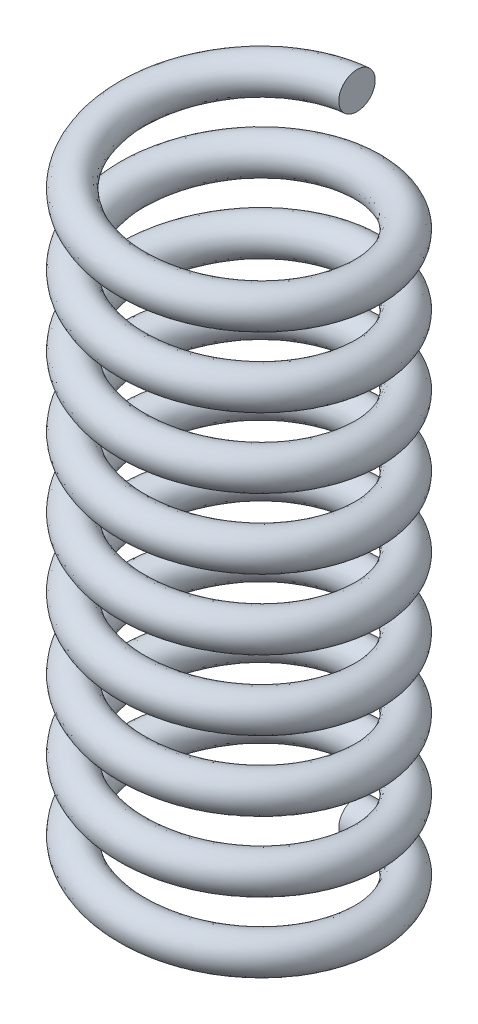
from build123d import *

# Parameters (mm, degrees)
AUSTRAGUNG2_PITCH       = 2.222222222
AUSTRAGUNG2_HEIGHT      = 20
AUSTRAGUNG2_RADIUS      = 3.75
AUSTRAGUNG2_START_ANGLE = -180
SKIZZE2_R               = 0.58


with BuildPart() as part:
    # Austragung2: sweep along a helix
    with BuildLine() as austragung2_path:
        add(Helix(AUSTRAGUNG2_PITCH, AUSTRAGUNG2_HEIGHT, AUSTRAGUNG2_RADIUS, center=(0, 0, 0), direction=(0, 1, 0), lefthand=True, mode=Mode.PRIVATE).rotate(Axis((0, 0, 0), (0, 1, 0)), AUSTRAGUNG2_START_ANGLE))
    # Skizze2 → Austragung2 (sweep)
    with BuildSketch(Plane(origin=(0, 0, 0), x_dir=(0, 0, -1), z_dir=(1, 0, 0))):
        with Locations((3.749983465, 19.996496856)):
            Circle(SKIZZE2_R)
    sweep(path=austragung2_path.line, is_frenet=True)


solid = part.part
